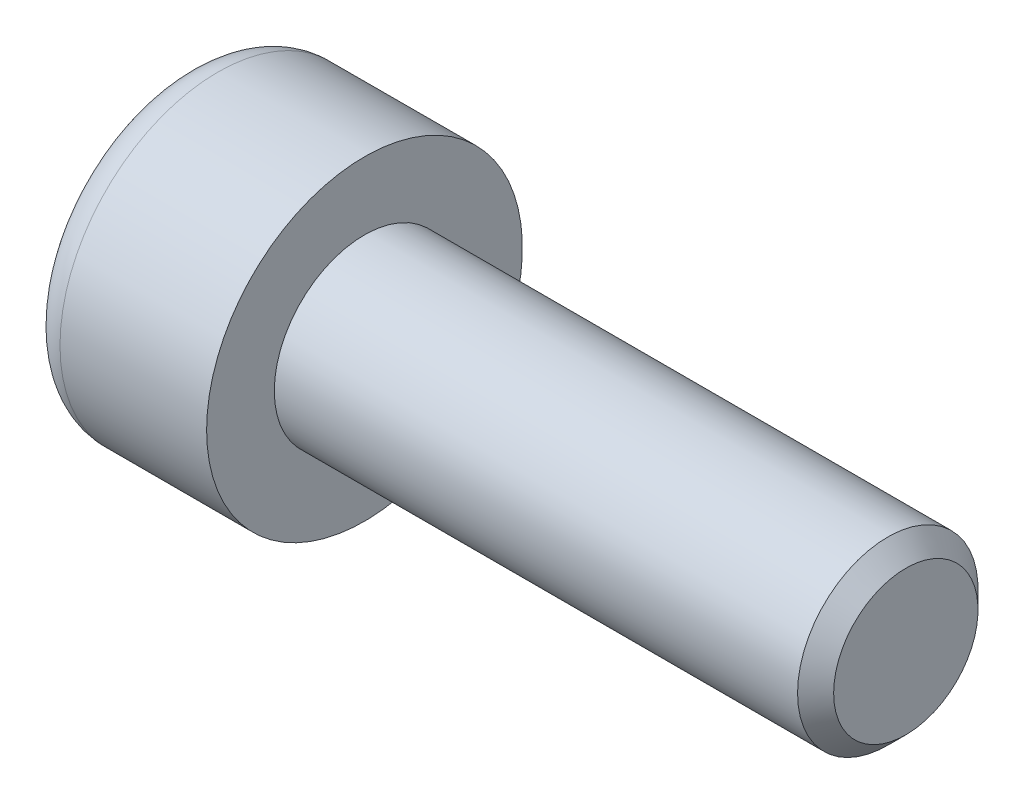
from build123d import *

# Parameters (mm, degrees)
CHANFREIN1_SIZE         = 0.4
CONG_1_R                = 0.75
ENL_V_MAT_EXTRU_1_DEPTH = 2.5


with BuildPart() as part:
    # Esquisse1 → Base-R_volution (revolve)
    with BuildSketch(Plane.XY, mode=Mode.PRIVATE) as base_r_volution_sk:
        Polygon((-4, 0), (-4, 3.5), (0, 3.5), (0, 2), (12, 2), (12, 0), align=None)
    revolve(base_r_volution_sk.sketch.rotate(Axis((-28.982684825, 0, 0), (1, 0, 0)), 90), axis=Axis((-28.982684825, 0, 0), (1, 0, 0)))

    # Chanfrein1
    chanfrein1_edges = [part.edges().sort_by_distance(p)[0] for p in [
        (12, 0, -2),
    ]]
    chamfer(chanfrein1_edges, length=CHANFREIN1_SIZE)

    # Cong_1
    cong_1_edges = [part.edges().sort_by_distance(p)[0] for p in [
        (-4, 0, -3.5),
    ]]
    fillet(cong_1_edges, radius=CONG_1_R)

    # Esquisse2 → Enl_v. mat.-Extru.1 (cut)
    with BuildSketch(Plane.ZY.offset(4)):
        Polygon((0.866025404, -1.5), (-0.866025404, -1.5), (-1.732050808, 0), (-0.866025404, 1.5), (0.866025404, 1.5), (1.732050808, 0), align=None)
    extrude(amount=-ENL_V_MAT_EXTRU_1_DEPTH, mode=Mode.SUBTRACT)


solid = part.part
